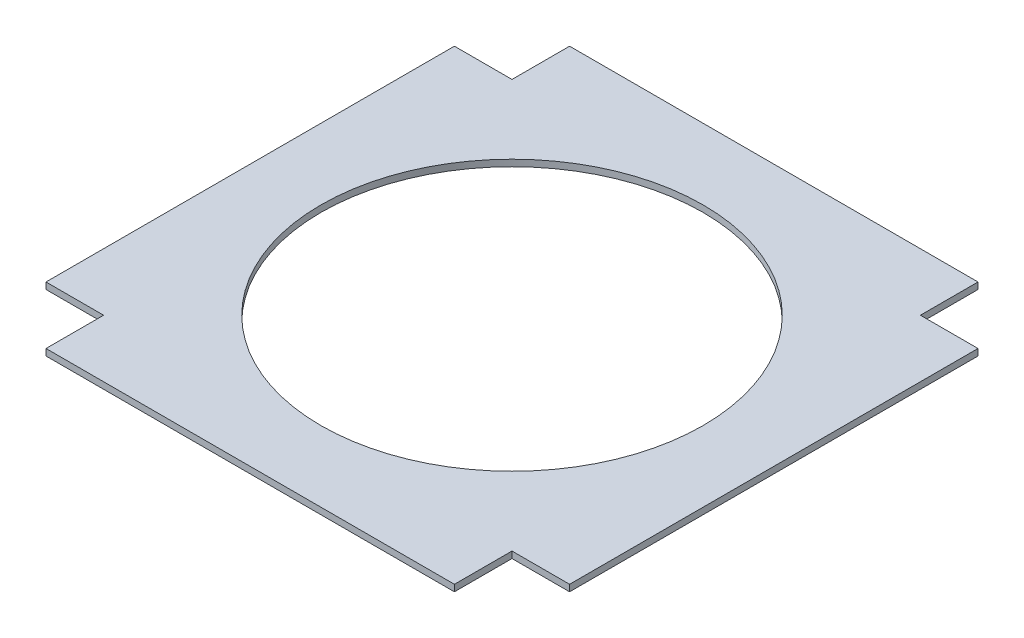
ISO-10303-21;
HEADER;
FILE_DESCRIPTION(('STEP AP214'),'2;1');
FILE_NAME('part.step','',(''),(''),'','','');
FILE_SCHEMA(('AUTOMOTIVE_DESIGN { 1 0 10303 214 1 1 1 1 }'));
ENDSEC;
DATA;
#1=APPLICATION_CONTEXT('core data for automotive mechanical design processes');
#2=APPLICATION_PROTOCOL_DEFINITION('international standard','automotive_design',2000,#1);
#3=PRODUCT_CONTEXT('',#1,'mechanical');
#4=PRODUCT('Part','Part','',(#3));
#5=PRODUCT_RELATED_PRODUCT_CATEGORY('part','',(#4));
#6=PRODUCT_DEFINITION_FORMATION('','',#4);
#7=PRODUCT_DEFINITION_CONTEXT('part definition',#1,'design');
#8=PRODUCT_DEFINITION('design','',#6,#7);
#9=PRODUCT_DEFINITION_SHAPE('','',#8);
#10=(LENGTH_UNIT() NAMED_UNIT(*) SI_UNIT(.MILLI.,.METRE.));
#11=(NAMED_UNIT(*) PLANE_ANGLE_UNIT() SI_UNIT($,.RADIAN.));
#12=(NAMED_UNIT(*) SI_UNIT($,.STERADIAN.) SOLID_ANGLE_UNIT());
#13=UNCERTAINTY_MEASURE_WITH_UNIT(LENGTH_MEASURE(1.E-05),#10,'distance_accuracy_value','');
#14=(GEOMETRIC_REPRESENTATION_CONTEXT(3) GLOBAL_UNCERTAINTY_ASSIGNED_CONTEXT((#13)) GLOBAL_UNIT_ASSIGNED_CONTEXT((#10,
#11,#12)) REPRESENTATION_CONTEXT('',''));
#15=CARTESIAN_POINT('',(0.,0.,0.));
#16=DIRECTION('',(0.,0.,1.));
#17=DIRECTION('',(1.,0.,0.));
#18=AXIS2_PLACEMENT_3D('',#15,#16,#17);
#19=CARTESIAN_POINT('',(0.,3.175,127.));
#20=DIRECTION('',(0.,0.,-1.));
#21=DIRECTION('',(-1.,0.,0.));
#22=AXIS2_PLACEMENT_3D('',#19,#20,#21);
#23=PLANE('',#22);
#24=DIRECTION('',(1.,0.,0.));
#25=VECTOR('',#24,1.);
#26=CARTESIAN_POINT('',(0.,0.,127.));
#27=LINE('',#26,#25);
#28=CARTESIAN_POINT('',(-99.06,0.,127.));
#29=VERTEX_POINT('',#28);
#30=CARTESIAN_POINT('',(99.06,0.,127.));
#31=VERTEX_POINT('',#30);
#32=EDGE_CURVE('E160',#29,#31,#27,.T.);
#33=ORIENTED_EDGE('',*,*,#32,.T.);
#34=DIRECTION('',(0.,-1.,0.));
#35=VECTOR('',#34,1.);
#36=CARTESIAN_POINT('',(99.06,3.175,127.));
#37=LINE('',#36,#35);
#38=CARTESIAN_POINT('',(99.06,3.175,127.));
#39=VERTEX_POINT('',#38);
#40=EDGE_CURVE('E11',#39,#31,#37,.T.);
#41=ORIENTED_EDGE('',*,*,#40,.F.);
#42=DIRECTION('',(1.,0.,0.));
#43=VECTOR('',#42,1.);
#44=CARTESIAN_POINT('',(0.,3.175,127.));
#45=LINE('',#44,#43);
#46=CARTESIAN_POINT('',(-99.06,3.175,127.));
#47=VERTEX_POINT('',#46);
#48=EDGE_CURVE('E378',#47,#39,#45,.T.);
#49=ORIENTED_EDGE('',*,*,#48,.F.);
#50=DIRECTION('',(0.,-1.,0.));
#51=VECTOR('',#50,1.);
#52=CARTESIAN_POINT('',(-99.06,3.175,127.));
#53=LINE('',#52,#51);
#54=EDGE_CURVE('E51',#47,#29,#53,.T.);
#55=ORIENTED_EDGE('',*,*,#54,.T.);
#56=EDGE_LOOP('',(#33,#41,#49,#55));
#57=FACE_BOUND('',#56,.T.);
#58=ADVANCED_FACE('F34',(#57),#23,.F.);
#59=CARTESIAN_POINT('',(99.0600000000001,3.175,0.));
#60=DIRECTION('',(-1.,0.,0.));
#61=DIRECTION('',(0.,0.,1.));
#62=AXIS2_PLACEMENT_3D('',#59,#60,#61);
#63=PLANE('',#62);
#64=DIRECTION('',(0.,0.,-1.));
#65=VECTOR('',#64,1.);
#66=CARTESIAN_POINT('',(99.0600000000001,0.,0.));
#67=LINE('',#66,#65);
#68=CARTESIAN_POINT('',(99.06,0.,99.0599999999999));
#69=VERTEX_POINT('',#68);
#70=EDGE_CURVE('E162',#31,#69,#67,.T.);
#71=ORIENTED_EDGE('',*,*,#70,.T.);
#72=DIRECTION('',(0.,-1.,0.));
#73=VECTOR('',#72,1.);
#74=CARTESIAN_POINT('',(99.06,3.175,99.0599999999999));
#75=LINE('',#74,#73);
#76=CARTESIAN_POINT('',(99.06,3.175,99.0599999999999));
#77=VERTEX_POINT('',#76);
#78=EDGE_CURVE('E43',#77,#69,#75,.T.);
#79=ORIENTED_EDGE('',*,*,#78,.F.);
#80=DIRECTION('',(0.,0.,-1.));
#81=VECTOR('',#80,1.);
#82=CARTESIAN_POINT('',(99.0600000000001,3.175,0.));
#83=LINE('',#82,#81);
#84=EDGE_CURVE('E102',#39,#77,#83,.T.);
#85=ORIENTED_EDGE('',*,*,#84,.F.);
#86=ORIENTED_EDGE('',*,*,#40,.T.);
#87=EDGE_LOOP('',(#71,#79,#85,#86));
#88=FACE_BOUND('',#87,.T.);
#89=ADVANCED_FACE('F213',(#88),#63,.F.);
#90=CARTESIAN_POINT('',(-2.46015329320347E-13,3.175,99.0599999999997));
#91=DIRECTION('',(0.,0.,1.));
#92=DIRECTION('',(1.,0.,0.));
#93=AXIS2_PLACEMENT_3D('',#90,#91,#92);
#94=PLANE('',#93);
#95=DIRECTION('',(-1.,0.,0.));
#96=VECTOR('',#95,1.);
#97=CARTESIAN_POINT('',(-2.46015329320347E-13,0.,99.0599999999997));
#98=LINE('',#97,#96);
#99=CARTESIAN_POINT('',(127.,0.,99.06));
#100=VERTEX_POINT('',#99);
#101=EDGE_CURVE('E165',#100,#69,#98,.T.);
#102=ORIENTED_EDGE('',*,*,#101,.F.);
#103=DIRECTION('',(0.,-1.,0.));
#104=VECTOR('',#103,1.);
#105=CARTESIAN_POINT('',(127.,3.175,99.06));
#106=LINE('',#105,#104);
#107=CARTESIAN_POINT('',(127.,3.175,99.06));
#108=VERTEX_POINT('',#107);
#109=EDGE_CURVE('E206',#108,#100,#106,.T.);
#110=ORIENTED_EDGE('',*,*,#109,.F.);
#111=DIRECTION('',(-1.,0.,0.));
#112=VECTOR('',#111,1.);
#113=CARTESIAN_POINT('',(-2.46015329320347E-13,3.175,99.0599999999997));
#114=LINE('',#113,#112);
#115=EDGE_CURVE('E212',#108,#77,#114,.T.);
#116=ORIENTED_EDGE('',*,*,#115,.T.);
#117=ORIENTED_EDGE('',*,*,#78,.T.);
#118=EDGE_LOOP('',(#102,#110,#116,#117));
#119=FACE_BOUND('',#118,.T.);
#120=ADVANCED_FACE('F210',(#119),#94,.T.);
#121=CARTESIAN_POINT('',(127.,3.175,0.));
#122=DIRECTION('',(-1.,0.,0.));
#123=DIRECTION('',(0.,0.,1.));
#124=AXIS2_PLACEMENT_3D('',#121,#122,#123);
#125=PLANE('',#124);
#126=DIRECTION('',(0.,0.,-1.));
#127=VECTOR('',#126,1.);
#128=CARTESIAN_POINT('',(127.,0.,0.));
#129=LINE('',#128,#127);
#130=CARTESIAN_POINT('',(127.,0.,-99.06));
#131=VERTEX_POINT('',#130);
#132=EDGE_CURVE('E168',#100,#131,#129,.T.);
#133=ORIENTED_EDGE('',*,*,#132,.T.);
#134=DIRECTION('',(0.,-1.,0.));
#135=VECTOR('',#134,1.);
#136=CARTESIAN_POINT('',(127.,3.175,-99.06));
#137=LINE('',#136,#135);
#138=CARTESIAN_POINT('',(127.,3.175,-99.06));
#139=VERTEX_POINT('',#138);
#140=EDGE_CURVE('E203',#139,#131,#137,.T.);
#141=ORIENTED_EDGE('',*,*,#140,.F.);
#142=DIRECTION('',(0.,0.,-1.));
#143=VECTOR('',#142,1.);
#144=CARTESIAN_POINT('',(127.,3.175,0.));
#145=LINE('',#144,#143);
#146=EDGE_CURVE('E231',#108,#139,#145,.T.);
#147=ORIENTED_EDGE('',*,*,#146,.F.);
#148=ORIENTED_EDGE('',*,*,#109,.T.);
#149=EDGE_LOOP('',(#133,#141,#147,#148));
#150=FACE_BOUND('',#149,.T.);
#151=ADVANCED_FACE('F221',(#150),#125,.F.);
#152=CARTESIAN_POINT('',(0.,3.175,-99.0599999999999));
#153=DIRECTION('',(0.,0.,1.));
#154=DIRECTION('',(1.,0.,0.));
#155=AXIS2_PLACEMENT_3D('',#152,#153,#154);
#156=PLANE('',#155);
#157=DIRECTION('',(-1.,0.,0.));
#158=VECTOR('',#157,1.);
#159=CARTESIAN_POINT('',(0.,0.,-99.0599999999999));
#160=LINE('',#159,#158);
#161=CARTESIAN_POINT('',(99.06,0.,-99.06));
#162=VERTEX_POINT('',#161);
#163=EDGE_CURVE('E170',#131,#162,#160,.T.);
#164=ORIENTED_EDGE('',*,*,#163,.T.);
#165=DIRECTION('',(0.,-1.,0.));
#166=VECTOR('',#165,1.);
#167=CARTESIAN_POINT('',(99.06,3.175,-99.06));
#168=LINE('',#167,#166);
#169=CARTESIAN_POINT('',(99.06,3.175,-99.06));
#170=VERTEX_POINT('',#169);
#171=EDGE_CURVE('E201',#170,#162,#168,.T.);
#172=ORIENTED_EDGE('',*,*,#171,.F.);
#173=DIRECTION('',(-1.,0.,0.));
#174=VECTOR('',#173,1.);
#175=CARTESIAN_POINT('',(0.,3.175,-99.0599999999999));
#176=LINE('',#175,#174);
#177=EDGE_CURVE('E227',#139,#170,#176,.T.);
#178=ORIENTED_EDGE('',*,*,#177,.F.);
#179=ORIENTED_EDGE('',*,*,#140,.T.);
#180=EDGE_LOOP('',(#164,#172,#178,#179));
#181=FACE_BOUND('',#180,.T.);
#182=ADVANCED_FACE('F225',(#181),#156,.F.);
#183=CARTESIAN_POINT('',(99.06,3.175,0.));
#184=DIRECTION('',(1.,0.,0.));
#185=DIRECTION('',(0.,0.,-1.));
#186=AXIS2_PLACEMENT_3D('',#183,#184,#185);
#187=PLANE('',#186);
#188=DIRECTION('',(0.,0.,1.));
#189=VECTOR('',#188,1.);
#190=CARTESIAN_POINT('',(99.06,0.,0.));
#191=LINE('',#190,#189);
#192=CARTESIAN_POINT('',(99.06,0.,-127.));
#193=VERTEX_POINT('',#192);
#194=EDGE_CURVE('E173',#193,#162,#191,.T.);
#195=ORIENTED_EDGE('',*,*,#194,.F.);
#196=DIRECTION('',(0.,-1.,0.));
#197=VECTOR('',#196,1.);
#198=CARTESIAN_POINT('',(99.06,3.175,-127.));
#199=LINE('',#198,#197);
#200=CARTESIAN_POINT('',(99.06,3.175,-127.));
#201=VERTEX_POINT('',#200);
#202=EDGE_CURVE('E199',#201,#193,#199,.T.);
#203=ORIENTED_EDGE('',*,*,#202,.F.);
#204=DIRECTION('',(0.,0.,1.));
#205=VECTOR('',#204,1.);
#206=CARTESIAN_POINT('',(99.06,3.175,0.));
#207=LINE('',#206,#205);
#208=EDGE_CURVE('E230',#201,#170,#207,.T.);
#209=ORIENTED_EDGE('',*,*,#208,.T.);
#210=ORIENTED_EDGE('',*,*,#171,.T.);
#211=EDGE_LOOP('',(#195,#203,#209,#210));
#212=FACE_BOUND('',#211,.T.);
#213=ADVANCED_FACE('F272',(#212),#187,.T.);
#214=CARTESIAN_POINT('',(0.,3.175,-127.));
#215=DIRECTION('',(0.,0.,-1.));
#216=DIRECTION('',(-1.,0.,0.));
#217=AXIS2_PLACEMENT_3D('',#214,#215,#216);
#218=PLANE('',#217);
#219=DIRECTION('',(1.,0.,0.));
#220=VECTOR('',#219,1.);
#221=CARTESIAN_POINT('',(0.,0.,-127.));
#222=LINE('',#221,#220);
#223=CARTESIAN_POINT('',(-99.06,0.,-127.));
#224=VERTEX_POINT('',#223);
#225=EDGE_CURVE('E176',#224,#193,#222,.T.);
#226=ORIENTED_EDGE('',*,*,#225,.F.);
#227=DIRECTION('',(0.,-1.,0.));
#228=VECTOR('',#227,1.);
#229=CARTESIAN_POINT('',(-99.06,3.175,-127.));
#230=LINE('',#229,#228);
#231=CARTESIAN_POINT('',(-99.06,3.175,-127.));
#232=VERTEX_POINT('',#231);
#233=EDGE_CURVE('E197',#232,#224,#230,.T.);
#234=ORIENTED_EDGE('',*,*,#233,.F.);
#235=DIRECTION('',(1.,0.,0.));
#236=VECTOR('',#235,1.);
#237=CARTESIAN_POINT('',(0.,3.175,-127.));
#238=LINE('',#237,#236);
#239=EDGE_CURVE('E233',#232,#201,#238,.T.);
#240=ORIENTED_EDGE('',*,*,#239,.T.);
#241=ORIENTED_EDGE('',*,*,#202,.T.);
#242=EDGE_LOOP('',(#226,#234,#240,#241));
#243=FACE_BOUND('',#242,.T.);
#244=ADVANCED_FACE('F275',(#243),#218,.T.);
#245=CARTESIAN_POINT('',(-99.06,3.175,0.));
#246=DIRECTION('',(1.,0.,0.));
#247=DIRECTION('',(0.,0.,-1.));
#248=AXIS2_PLACEMENT_3D('',#245,#246,#247);
#249=PLANE('',#248);
#250=DIRECTION('',(0.,0.,1.));
#251=VECTOR('',#250,1.);
#252=CARTESIAN_POINT('',(-99.06,0.,0.));
#253=LINE('',#252,#251);
#254=CARTESIAN_POINT('',(-99.06,0.,-99.06));
#255=VERTEX_POINT('',#254);
#256=EDGE_CURVE('E179',#224,#255,#253,.T.);
#257=ORIENTED_EDGE('',*,*,#256,.T.);
#258=DIRECTION('',(0.,-1.,0.));
#259=VECTOR('',#258,1.);
#260=CARTESIAN_POINT('',(-99.06,3.175,-99.06));
#261=LINE('',#260,#259);
#262=CARTESIAN_POINT('',(-99.06,3.175,-99.06));
#263=VERTEX_POINT('',#262);
#264=EDGE_CURVE('E195',#263,#255,#261,.T.);
#265=ORIENTED_EDGE('',*,*,#264,.F.);
#266=DIRECTION('',(0.,0.,1.));
#267=VECTOR('',#266,1.);
#268=CARTESIAN_POINT('',(-99.06,3.175,0.));
#269=LINE('',#268,#267);
#270=EDGE_CURVE('E152',#232,#263,#269,.T.);
#271=ORIENTED_EDGE('',*,*,#270,.F.);
#272=ORIENTED_EDGE('',*,*,#233,.T.);
#273=EDGE_LOOP('',(#257,#265,#271,#272));
#274=FACE_BOUND('',#273,.T.);
#275=ADVANCED_FACE('F243',(#274),#249,.F.);
#276=CARTESIAN_POINT('',(0.,3.175,-99.06));
#277=DIRECTION('',(0.,0.,-1.));
#278=DIRECTION('',(-1.,0.,0.));
#279=AXIS2_PLACEMENT_3D('',#276,#277,#278);
#280=PLANE('',#279);
#281=DIRECTION('',(1.,0.,0.));
#282=VECTOR('',#281,1.);
#283=CARTESIAN_POINT('',(0.,0.,-99.06));
#284=LINE('',#283,#282);
#285=CARTESIAN_POINT('',(-127.,0.,-99.06));
#286=VERTEX_POINT('',#285);
#287=EDGE_CURVE('E182',#286,#255,#284,.T.);
#288=ORIENTED_EDGE('',*,*,#287,.F.);
#289=DIRECTION('',(0.,-1.,0.));
#290=VECTOR('',#289,1.);
#291=CARTESIAN_POINT('',(-127.,3.175,-99.06));
#292=LINE('',#291,#290);
#293=CARTESIAN_POINT('',(-127.,3.175,-99.06));
#294=VERTEX_POINT('',#293);
#295=EDGE_CURVE('E139',#294,#286,#292,.T.);
#296=ORIENTED_EDGE('',*,*,#295,.F.);
#297=DIRECTION('',(1.,0.,0.));
#298=VECTOR('',#297,1.);
#299=CARTESIAN_POINT('',(0.,3.175,-99.06));
#300=LINE('',#299,#298);
#301=EDGE_CURVE('E150',#294,#263,#300,.T.);
#302=ORIENTED_EDGE('',*,*,#301,.T.);
#303=ORIENTED_EDGE('',*,*,#264,.T.);
#304=EDGE_LOOP('',(#288,#296,#302,#303));
#305=FACE_BOUND('',#304,.T.);
#306=ADVANCED_FACE('F247',(#305),#280,.T.);
#307=CARTESIAN_POINT('',(-127.,3.175,0.));
#308=DIRECTION('',(-1.,0.,0.));
#309=DIRECTION('',(0.,0.,1.));
#310=AXIS2_PLACEMENT_3D('',#307,#308,#309);
#311=PLANE('',#310);
#312=DIRECTION('',(0.,0.,-1.));
#313=VECTOR('',#312,1.);
#314=CARTESIAN_POINT('',(-127.,0.,0.));
#315=LINE('',#314,#313);
#316=CARTESIAN_POINT('',(-127.,0.,99.06));
#317=VERTEX_POINT('',#316);
#318=EDGE_CURVE('E136',#317,#286,#315,.T.);
#319=ORIENTED_EDGE('',*,*,#318,.F.);
#320=DIRECTION('',(0.,-1.,0.));
#321=VECTOR('',#320,1.);
#322=CARTESIAN_POINT('',(-127.,3.175,99.06));
#323=LINE('',#322,#321);
#324=CARTESIAN_POINT('',(-127.,3.175,99.06));
#325=VERTEX_POINT('',#324);
#326=EDGE_CURVE('E130',#325,#317,#323,.T.);
#327=ORIENTED_EDGE('',*,*,#326,.F.);
#328=DIRECTION('',(0.,0.,-1.));
#329=VECTOR('',#328,1.);
#330=CARTESIAN_POINT('',(-127.,3.175,0.));
#331=LINE('',#330,#329);
#332=EDGE_CURVE('E134',#325,#294,#331,.T.);
#333=ORIENTED_EDGE('',*,*,#332,.T.);
#334=ORIENTED_EDGE('',*,*,#295,.T.);
#335=EDGE_LOOP('',(#319,#327,#333,#334));
#336=FACE_BOUND('',#335,.T.);
#337=ADVANCED_FACE('F132',(#336),#311,.T.);
#338=CARTESIAN_POINT('',(0.,3.175,99.06));
#339=DIRECTION('',(0.,0.,-1.));
#340=DIRECTION('',(-1.,0.,0.));
#341=AXIS2_PLACEMENT_3D('',#338,#339,#340);
#342=PLANE('',#341);
#343=DIRECTION('',(1.,0.,0.));
#344=VECTOR('',#343,1.);
#345=CARTESIAN_POINT('',(0.,0.,99.06));
#346=LINE('',#345,#344);
#347=CARTESIAN_POINT('',(-99.0599999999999,0.,99.06));
#348=VERTEX_POINT('',#347);
#349=EDGE_CURVE('E186',#317,#348,#346,.T.);
#350=ORIENTED_EDGE('',*,*,#349,.T.);
#351=DIRECTION('',(0.,-1.,0.));
#352=VECTOR('',#351,1.);
#353=CARTESIAN_POINT('',(-99.0599999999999,3.175,99.06));
#354=LINE('',#353,#352);
#355=CARTESIAN_POINT('',(-99.0599999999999,3.175,99.06));
#356=VERTEX_POINT('',#355);
#357=EDGE_CURVE('E90',#356,#348,#354,.T.);
#358=ORIENTED_EDGE('',*,*,#357,.F.);
#359=DIRECTION('',(1.,0.,0.));
#360=VECTOR('',#359,1.);
#361=CARTESIAN_POINT('',(0.,3.175,99.06));
#362=LINE('',#361,#360);
#363=EDGE_CURVE('E141',#325,#356,#362,.T.);
#364=ORIENTED_EDGE('',*,*,#363,.F.);
#365=ORIENTED_EDGE('',*,*,#326,.T.);
#366=EDGE_LOOP('',(#350,#358,#364,#365));
#367=FACE_BOUND('',#366,.T.);
#368=ADVANCED_FACE('F142',(#367),#342,.F.);
#369=CARTESIAN_POINT('',(0.,3.175,0.));
#370=DIRECTION('',(0.,-1.,0.));
#371=DIRECTION('',(0.,0.,-1.));
#372=AXIS2_PLACEMENT_3D('',#369,#370,#371);
#373=CYLINDRICAL_SURFACE('',#372,92.71);
#374=CARTESIAN_POINT('',(0.,3.175,0.));
#375=DIRECTION('',(0.,1.,0.));
#376=DIRECTION('',(0.,0.,1.));
#377=AXIS2_PLACEMENT_3D('',#374,#375,#376);
#378=CIRCLE('',#377,92.71);
#379=CARTESIAN_POINT('',(0.,3.175,92.71));
#380=VERTEX_POINT('',#379);
#381=EDGE_CURVE('E191',#380,#380,#378,.T.);
#382=ORIENTED_EDGE('',*,*,#381,.T.);
#383=EDGE_LOOP('',(#382));
#384=FACE_BOUND('',#383,.T.);
#385=CARTESIAN_POINT('',(0.,0.,0.));
#386=DIRECTION('',(0.,1.,0.));
#387=DIRECTION('',(0.,0.,1.));
#388=AXIS2_PLACEMENT_3D('',#385,#386,#387);
#389=CIRCLE('',#388,92.71);
#390=CARTESIAN_POINT('',(0.,0.,92.71));
#391=VERTEX_POINT('',#390);
#392=EDGE_CURVE('E157',#391,#391,#389,.T.);
#393=ORIENTED_EDGE('',*,*,#392,.F.);
#394=EDGE_LOOP('',(#393));
#395=FACE_BOUND('',#394,.T.);
#396=ADVANCED_FACE('F36',(#384,#395),#373,.F.);
#397=CARTESIAN_POINT('',(-99.0599999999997,3.175,-2.46015329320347E-13));
#398=DIRECTION('',(-1.,0.,0.));
#399=DIRECTION('',(0.,0.,1.));
#400=AXIS2_PLACEMENT_3D('',#397,#398,#399);
#401=PLANE('',#400);
#402=DIRECTION('',(0.,0.,-1.));
#403=VECTOR('',#402,1.);
#404=CARTESIAN_POINT('',(-99.0599999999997,0.,-2.46015329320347E-13));
#405=LINE('',#404,#403);
#406=EDGE_CURVE('E188',#29,#348,#405,.T.);
#407=ORIENTED_EDGE('',*,*,#406,.F.);
#408=ORIENTED_EDGE('',*,*,#54,.F.);
#409=DIRECTION('',(0.,0.,-1.));
#410=VECTOR('',#409,1.);
#411=CARTESIAN_POINT('',(-99.0599999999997,3.175,-2.46015329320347E-13));
#412=LINE('',#411,#410);
#413=EDGE_CURVE('E145',#47,#356,#412,.T.);
#414=ORIENTED_EDGE('',*,*,#413,.T.);
#415=ORIENTED_EDGE('',*,*,#357,.T.);
#416=EDGE_LOOP('',(#407,#408,#414,#415));
#417=FACE_BOUND('',#416,.T.);
#418=ADVANCED_FACE('F248',(#417),#401,.T.);
#419=CARTESIAN_POINT('',(0.,3.175,0.));
#420=DIRECTION('',(0.,1.,0.));
#421=DIRECTION('',(0.,0.,1.));
#422=AXIS2_PLACEMENT_3D('',#419,#420,#421);
#423=PLANE('',#422);
#424=ORIENTED_EDGE('',*,*,#381,.F.);
#425=EDGE_LOOP('',(#424));
#426=FACE_BOUND('',#425,.T.);
#427=ORIENTED_EDGE('',*,*,#48,.T.);
#428=ORIENTED_EDGE('',*,*,#84,.T.);
#429=ORIENTED_EDGE('',*,*,#115,.F.);
#430=ORIENTED_EDGE('',*,*,#146,.T.);
#431=ORIENTED_EDGE('',*,*,#177,.T.);
#432=ORIENTED_EDGE('',*,*,#208,.F.);
#433=ORIENTED_EDGE('',*,*,#239,.F.);
#434=ORIENTED_EDGE('',*,*,#270,.T.);
#435=ORIENTED_EDGE('',*,*,#301,.F.);
#436=ORIENTED_EDGE('',*,*,#332,.F.);
#437=ORIENTED_EDGE('',*,*,#363,.T.);
#438=ORIENTED_EDGE('',*,*,#413,.F.);
#439=EDGE_LOOP('',(#427,#428,#429,#430,#431,#432,#433,#434,#435,#436,#437,#438));
#440=FACE_BOUND('',#439,.T.);
#441=ADVANCED_FACE('F148',(#426,#440),#423,.T.);
#442=CARTESIAN_POINT('',(0.,0.,0.));
#443=DIRECTION('',(0.,1.,0.));
#444=DIRECTION('',(0.,0.,1.));
#445=AXIS2_PLACEMENT_3D('',#442,#443,#444);
#446=PLANE('',#445);
#447=ORIENTED_EDGE('',*,*,#392,.T.);
#448=EDGE_LOOP('',(#447));
#449=FACE_BOUND('',#448,.T.);
#450=ORIENTED_EDGE('',*,*,#32,.F.);
#451=ORIENTED_EDGE('',*,*,#406,.T.);
#452=ORIENTED_EDGE('',*,*,#349,.F.);
#453=ORIENTED_EDGE('',*,*,#318,.T.);
#454=ORIENTED_EDGE('',*,*,#287,.T.);
#455=ORIENTED_EDGE('',*,*,#256,.F.);
#456=ORIENTED_EDGE('',*,*,#225,.T.);
#457=ORIENTED_EDGE('',*,*,#194,.T.);
#458=ORIENTED_EDGE('',*,*,#163,.F.);
#459=ORIENTED_EDGE('',*,*,#132,.F.);
#460=ORIENTED_EDGE('',*,*,#101,.T.);
#461=ORIENTED_EDGE('',*,*,#70,.F.);
#462=EDGE_LOOP('',(#450,#451,#452,#453,#454,#455,#456,#457,#458,#459,#460,#461));
#463=FACE_BOUND('',#462,.T.);
#464=ADVANCED_FACE('F217',(#449,#463),#446,.F.);
#465=CLOSED_SHELL('',(#58,#89,#120,#151,#182,#213,#244,#275,#306,#337,#368,#396,#418,#441,#464));
#466=MANIFOLD_SOLID_BREP('B2',#465);
#467=ADVANCED_BREP_SHAPE_REPRESENTATION('',(#18,#466),#14);
#468=SHAPE_DEFINITION_REPRESENTATION(#9,#467);
ENDSEC;
END-ISO-10303-21;
